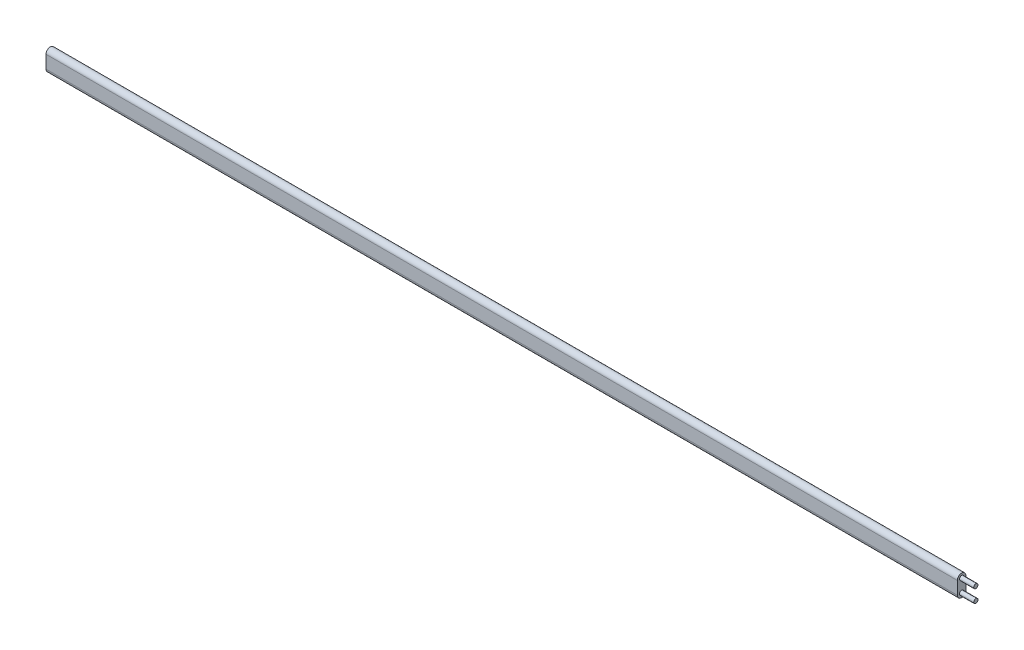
from build123d import *

# Parameters (mm, degrees)
EXTRUSION1_DEPTH = 640
ESQUISSE2_R      = 1.5
EXTRUSION2_DEPTH = 10


with BuildPart() as part:
    # Esquisse1 → Extrusion1 (new body)
    with BuildSketch(Plane(origin=(0, 0, 0), x_dir=(0, 0, -1), z_dir=(1, 0, 0))):
        with BuildLine():
            Line((-3, -4.5), (-3, 4.5))
            ThreePointArc((-3, 4.5), (0, 7.5), (3, 4.5))
            Line((3, 4.5), (3, -4.5))
            ThreePointArc((3, -4.5), (0, -7.5), (-3, -4.5))
        make_face()
    extrude(amount=-EXTRUSION1_DEPTH)

    # Esquisse2 → Extrusion2 (add)
    with BuildSketch(Plane(origin=(0, 0, 0), x_dir=(0, 0, -1), z_dir=(1, 0, 0))):
        with Locations(Location((0, 4.5, 0), (0, 0, 180))):
            Circle(ESQUISSE2_R)
        with Locations(Location((0, -4.5, 0), (0, 0, 180))):
            Circle(ESQUISSE2_R)
    extrude(amount=EXTRUSION2_DEPTH)


solid = part.part
